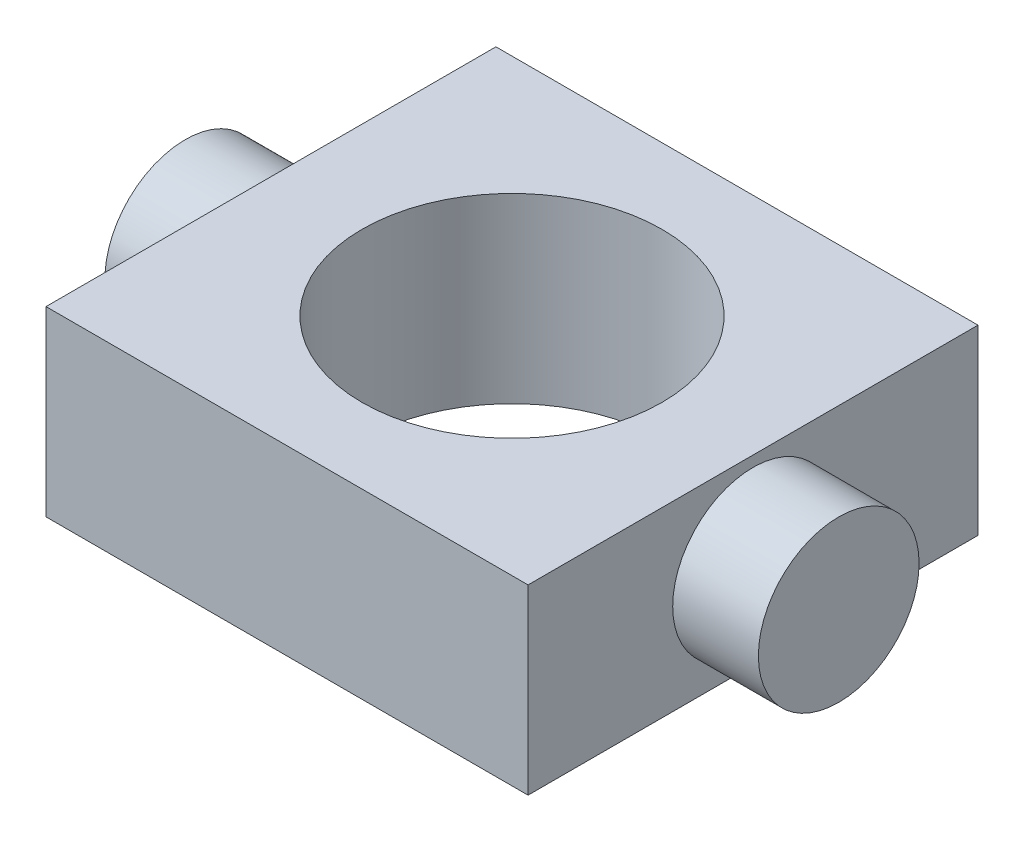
ISO-10303-21;
HEADER;
FILE_DESCRIPTION(('STEP AP214'),'2;1');
FILE_NAME('part.step','',(''),(''),'','','');
FILE_SCHEMA(('AUTOMOTIVE_DESIGN { 1 0 10303 214 1 1 1 1 }'));
ENDSEC;
DATA;
#1=APPLICATION_CONTEXT('core data for automotive mechanical design processes');
#2=APPLICATION_PROTOCOL_DEFINITION('international standard','automotive_design',2000,#1);
#3=PRODUCT_CONTEXT('',#1,'mechanical');
#4=PRODUCT('Part','Part','',(#3));
#5=PRODUCT_RELATED_PRODUCT_CATEGORY('part','',(#4));
#6=PRODUCT_DEFINITION_FORMATION('','',#4);
#7=PRODUCT_DEFINITION_CONTEXT('part definition',#1,'design');
#8=PRODUCT_DEFINITION('design','',#6,#7);
#9=PRODUCT_DEFINITION_SHAPE('','',#8);
#10=(LENGTH_UNIT() NAMED_UNIT(*) SI_UNIT(.MILLI.,.METRE.));
#11=(NAMED_UNIT(*) PLANE_ANGLE_UNIT() SI_UNIT($,.RADIAN.));
#12=(NAMED_UNIT(*) SI_UNIT($,.STERADIAN.) SOLID_ANGLE_UNIT());
#13=UNCERTAINTY_MEASURE_WITH_UNIT(LENGTH_MEASURE(1.E-05),#10,'distance_accuracy_value','');
#14=(GEOMETRIC_REPRESENTATION_CONTEXT(3) GLOBAL_UNCERTAINTY_ASSIGNED_CONTEXT((#13)) GLOBAL_UNIT_ASSIGNED_CONTEXT((#10,
#11,#12)) REPRESENTATION_CONTEXT('',''));
#15=CARTESIAN_POINT('',(0.,0.,0.));
#16=DIRECTION('',(0.,0.,1.));
#17=DIRECTION('',(1.,0.,0.));
#18=AXIS2_PLACEMENT_3D('',#15,#16,#17);
#19=CARTESIAN_POINT('',(45.,0.,42.));
#20=DIRECTION('',(-1.,0.,0.));
#21=DIRECTION('',(0.,0.,1.));
#22=AXIS2_PLACEMENT_3D('',#19,#20,#21);
#23=PLANE('',#22);
#24=DIRECTION('',(0.,1.,0.));
#25=VECTOR('',#24,1.);
#26=CARTESIAN_POINT('',(45.,0.,0.));
#27=LINE('',#26,#25);
#28=CARTESIAN_POINT('',(45.,0.,0.));
#29=VERTEX_POINT('',#28);
#30=CARTESIAN_POINT('',(45.,17.,0.));
#31=VERTEX_POINT('',#30);
#32=EDGE_CURVE('E73',#29,#31,#27,.T.);
#33=ORIENTED_EDGE('',*,*,#32,.T.);
#34=DIRECTION('',(0.,0.,-1.));
#35=VECTOR('',#34,1.);
#36=CARTESIAN_POINT('',(45.,17.,42.));
#37=LINE('',#36,#35);
#38=CARTESIAN_POINT('',(45.,17.,42.));
#39=VERTEX_POINT('',#38);
#40=EDGE_CURVE('E102',#39,#31,#37,.T.);
#41=ORIENTED_EDGE('',*,*,#40,.F.);
#42=DIRECTION('',(0.,1.,0.));
#43=VECTOR('',#42,1.);
#44=CARTESIAN_POINT('',(45.,0.,42.));
#45=LINE('',#44,#43);
#46=CARTESIAN_POINT('',(45.,0.,42.));
#47=VERTEX_POINT('',#46);
#48=EDGE_CURVE('E46',#47,#39,#45,.T.);
#49=ORIENTED_EDGE('',*,*,#48,.F.);
#50=DIRECTION('',(0.,0.,-1.));
#51=VECTOR('',#50,1.);
#52=CARTESIAN_POINT('',(45.,0.,42.));
#53=LINE('',#52,#51);
#54=EDGE_CURVE('E83',#47,#29,#53,.T.);
#55=ORIENTED_EDGE('',*,*,#54,.T.);
#56=EDGE_LOOP('',(#33,#41,#49,#55));
#57=FACE_BOUND('',#56,.T.);
#58=CARTESIAN_POINT('',(45.,8.5,21.));
#59=DIRECTION('',(-1.,0.,0.));
#60=DIRECTION('',(0.,0.,1.));
#61=AXIS2_PLACEMENT_3D('',#58,#59,#60);
#62=CIRCLE('',#61,7.5);
#63=CARTESIAN_POINT('',(45.,8.5,28.5));
#64=VERTEX_POINT('',#63);
#65=EDGE_CURVE('E11',#64,#64,#62,.F.);
#66=ORIENTED_EDGE('',*,*,#65,.F.);
#67=EDGE_LOOP('',(#66));
#68=FACE_BOUND('',#67,.T.);
#69=ADVANCED_FACE('F26',(#57,#68),#23,.F.);
#70=CARTESIAN_POINT('',(0.,0.,42.));
#71=DIRECTION('',(1.,0.,0.));
#72=DIRECTION('',(0.,0.,-1.));
#73=AXIS2_PLACEMENT_3D('',#70,#71,#72);
#74=PLANE('',#73);
#75=CARTESIAN_POINT('',(0.,8.5,21.));
#76=DIRECTION('',(1.,0.,0.));
#77=DIRECTION('',(0.,0.,-1.));
#78=AXIS2_PLACEMENT_3D('',#75,#76,#77);
#79=CIRCLE('',#78,7.5);
#80=CARTESIAN_POINT('',(0.,8.5,13.5));
#81=VERTEX_POINT('',#80);
#82=EDGE_CURVE('E145',#81,#81,#79,.T.);
#83=ORIENTED_EDGE('',*,*,#82,.T.);
#84=EDGE_LOOP('',(#83));
#85=FACE_BOUND('',#84,.T.);
#86=DIRECTION('',(0.,-1.,0.));
#87=VECTOR('',#86,1.);
#88=CARTESIAN_POINT('',(0.,0.,0.));
#89=LINE('',#88,#87);
#90=CARTESIAN_POINT('',(0.,17.,0.));
#91=VERTEX_POINT('',#90);
#92=CARTESIAN_POINT('',(0.,0.,0.));
#93=VERTEX_POINT('',#92);
#94=EDGE_CURVE('E72',#91,#93,#89,.T.);
#95=ORIENTED_EDGE('',*,*,#94,.T.);
#96=DIRECTION('',(0.,0.,-1.));
#97=VECTOR('',#96,1.);
#98=CARTESIAN_POINT('',(0.,0.,42.));
#99=LINE('',#98,#97);
#100=CARTESIAN_POINT('',(0.,0.,42.));
#101=VERTEX_POINT('',#100);
#102=EDGE_CURVE('E34',#101,#93,#99,.T.);
#103=ORIENTED_EDGE('',*,*,#102,.F.);
#104=DIRECTION('',(0.,-1.,0.));
#105=VECTOR('',#104,1.);
#106=CARTESIAN_POINT('',(0.,0.,42.));
#107=LINE('',#106,#105);
#108=CARTESIAN_POINT('',(0.,17.,42.));
#109=VERTEX_POINT('',#108);
#110=EDGE_CURVE('E96',#109,#101,#107,.T.);
#111=ORIENTED_EDGE('',*,*,#110,.F.);
#112=DIRECTION('',(0.,0.,-1.));
#113=VECTOR('',#112,1.);
#114=CARTESIAN_POINT('',(0.,17.,42.));
#115=LINE('',#114,#113);
#116=EDGE_CURVE('E85',#109,#91,#115,.T.);
#117=ORIENTED_EDGE('',*,*,#116,.T.);
#118=EDGE_LOOP('',(#95,#103,#111,#117));
#119=FACE_BOUND('',#118,.T.);
#120=ADVANCED_FACE('F28',(#85,#119),#74,.F.);
#121=CARTESIAN_POINT('',(0.,0.,42.));
#122=DIRECTION('',(0.,1.,0.));
#123=DIRECTION('',(0.,0.,1.));
#124=AXIS2_PLACEMENT_3D('',#121,#122,#123);
#125=PLANE('',#124);
#126=CARTESIAN_POINT('',(22.5,0.,21.));
#127=DIRECTION('',(0.,1.,0.));
#128=DIRECTION('',(0.,0.,1.));
#129=AXIS2_PLACEMENT_3D('',#126,#127,#128);
#130=CIRCLE('',#129,14.);
#131=CARTESIAN_POINT('',(22.5,0.,35.));
#132=VERTEX_POINT('',#131);
#133=EDGE_CURVE('E86',#132,#132,#130,.T.);
#134=ORIENTED_EDGE('',*,*,#133,.T.);
#135=EDGE_LOOP('',(#134));
#136=FACE_BOUND('',#135,.T.);
#137=DIRECTION('',(1.,0.,0.));
#138=VECTOR('',#137,1.);
#139=CARTESIAN_POINT('',(0.,0.,0.));
#140=LINE('',#139,#138);
#141=EDGE_CURVE('E67',#93,#29,#140,.T.);
#142=ORIENTED_EDGE('',*,*,#141,.T.);
#143=ORIENTED_EDGE('',*,*,#54,.F.);
#144=DIRECTION('',(1.,0.,0.));
#145=VECTOR('',#144,1.);
#146=CARTESIAN_POINT('',(0.,0.,42.));
#147=LINE('',#146,#145);
#148=EDGE_CURVE('E80',#101,#47,#147,.T.);
#149=ORIENTED_EDGE('',*,*,#148,.F.);
#150=ORIENTED_EDGE('',*,*,#102,.T.);
#151=EDGE_LOOP('',(#142,#143,#149,#150));
#152=FACE_BOUND('',#151,.T.);
#153=ADVANCED_FACE('F79',(#136,#152),#125,.F.);
#154=CARTESIAN_POINT('',(0.,17.,42.));
#155=DIRECTION('',(0.,-1.,0.));
#156=DIRECTION('',(0.,0.,-1.));
#157=AXIS2_PLACEMENT_3D('',#154,#155,#156);
#158=PLANE('',#157);
#159=CARTESIAN_POINT('',(22.5,17.,21.));
#160=DIRECTION('',(0.,1.,0.));
#161=DIRECTION('',(0.,0.,1.));
#162=AXIS2_PLACEMENT_3D('',#159,#160,#161);
#163=CIRCLE('',#162,14.);
#164=CARTESIAN_POINT('',(22.5,17.,35.));
#165=VERTEX_POINT('',#164);
#166=EDGE_CURVE('E89',#165,#165,#163,.T.);
#167=ORIENTED_EDGE('',*,*,#166,.F.);
#168=EDGE_LOOP('',(#167));
#169=FACE_BOUND('',#168,.T.);
#170=DIRECTION('',(-1.,0.,0.));
#171=VECTOR('',#170,1.);
#172=CARTESIAN_POINT('',(0.,17.,0.));
#173=LINE('',#172,#171);
#174=EDGE_CURVE('E94',#31,#91,#173,.T.);
#175=ORIENTED_EDGE('',*,*,#174,.T.);
#176=ORIENTED_EDGE('',*,*,#116,.F.);
#177=DIRECTION('',(-1.,0.,0.));
#178=VECTOR('',#177,1.);
#179=CARTESIAN_POINT('',(0.,17.,42.));
#180=LINE('',#179,#178);
#181=EDGE_CURVE('E41',#39,#109,#180,.T.);
#182=ORIENTED_EDGE('',*,*,#181,.F.);
#183=ORIENTED_EDGE('',*,*,#40,.T.);
#184=EDGE_LOOP('',(#175,#176,#182,#183));
#185=FACE_BOUND('',#184,.T.);
#186=ADVANCED_FACE('F108',(#169,#185),#158,.F.);
#187=CARTESIAN_POINT('',(0.,17.,42.));
#188=DIRECTION('',(0.,0.,-1.));
#189=DIRECTION('',(-1.,0.,0.));
#190=AXIS2_PLACEMENT_3D('',#187,#188,#189);
#191=PLANE('',#190);
#192=ORIENTED_EDGE('',*,*,#110,.T.);
#193=ORIENTED_EDGE('',*,*,#148,.T.);
#194=ORIENTED_EDGE('',*,*,#48,.T.);
#195=ORIENTED_EDGE('',*,*,#181,.T.);
#196=EDGE_LOOP('',(#192,#193,#194,#195));
#197=FACE_BOUND('',#196,.T.);
#198=ADVANCED_FACE('F109',(#197),#191,.F.);
#199=CARTESIAN_POINT('',(0.,17.,0.));
#200=DIRECTION('',(0.,0.,-1.));
#201=DIRECTION('',(-1.,0.,0.));
#202=AXIS2_PLACEMENT_3D('',#199,#200,#201);
#203=PLANE('',#202);
#204=ORIENTED_EDGE('',*,*,#94,.F.);
#205=ORIENTED_EDGE('',*,*,#174,.F.);
#206=ORIENTED_EDGE('',*,*,#32,.F.);
#207=ORIENTED_EDGE('',*,*,#141,.F.);
#208=EDGE_LOOP('',(#204,#205,#206,#207));
#209=FACE_BOUND('',#208,.T.);
#210=ADVANCED_FACE('F69',(#209),#203,.T.);
#211=CARTESIAN_POINT('',(22.5,0.,21.));
#212=DIRECTION('',(0.,1.,0.));
#213=DIRECTION('',(0.,0.,1.));
#214=AXIS2_PLACEMENT_3D('',#211,#212,#213);
#215=CYLINDRICAL_SURFACE('',#214,14.);
#216=ORIENTED_EDGE('',*,*,#133,.F.);
#217=EDGE_LOOP('',(#216));
#218=FACE_BOUND('',#217,.T.);
#219=ORIENTED_EDGE('',*,*,#166,.T.);
#220=EDGE_LOOP('',(#219));
#221=FACE_BOUND('',#220,.T.);
#222=ADVANCED_FACE('F116',(#218,#221),#215,.F.);
#223=CARTESIAN_POINT('',(53.,8.5,21.));
#224=DIRECTION('',(-1.,0.,0.));
#225=DIRECTION('',(0.,0.,1.));
#226=AXIS2_PLACEMENT_3D('',#223,#224,#225);
#227=CYLINDRICAL_SURFACE('',#226,7.5);
#228=CARTESIAN_POINT('',(53.,8.5,21.));
#229=DIRECTION('',(1.,0.,0.));
#230=DIRECTION('',(0.,0.,-1.));
#231=AXIS2_PLACEMENT_3D('',#228,#229,#230);
#232=CIRCLE('',#231,7.5);
#233=CARTESIAN_POINT('',(53.,8.5,13.5));
#234=VERTEX_POINT('',#233);
#235=EDGE_CURVE('E138',#234,#234,#232,.T.);
#236=ORIENTED_EDGE('',*,*,#235,.F.);
#237=EDGE_LOOP('',(#236));
#238=FACE_BOUND('',#237,.T.);
#239=ORIENTED_EDGE('',*,*,#65,.T.);
#240=EDGE_LOOP('',(#239));
#241=FACE_BOUND('',#240,.T.);
#242=ADVANCED_FACE('F134',(#238,#241),#227,.T.);
#243=CARTESIAN_POINT('',(53.,8.5,21.));
#244=DIRECTION('',(1.,0.,0.));
#245=DIRECTION('',(0.,0.,-1.));
#246=AXIS2_PLACEMENT_3D('',#243,#244,#245);
#247=PLANE('',#246);
#248=ORIENTED_EDGE('',*,*,#235,.T.);
#249=EDGE_LOOP('',(#248));
#250=FACE_BOUND('',#249,.T.);
#251=ADVANCED_FACE('F152',(#250),#247,.T.);
#252=CARTESIAN_POINT('',(-8.,8.5,21.));
#253=DIRECTION('',(1.,0.,0.));
#254=DIRECTION('',(0.,0.,-1.));
#255=AXIS2_PLACEMENT_3D('',#252,#253,#254);
#256=CYLINDRICAL_SURFACE('',#255,7.5);
#257=CARTESIAN_POINT('',(-8.,8.5,21.));
#258=DIRECTION('',(1.,0.,0.));
#259=DIRECTION('',(0.,0.,-1.));
#260=AXIS2_PLACEMENT_3D('',#257,#258,#259);
#261=CIRCLE('',#260,7.5);
#262=CARTESIAN_POINT('',(-8.,8.5,13.5));
#263=VERTEX_POINT('',#262);
#264=EDGE_CURVE('E140',#263,#263,#261,.T.);
#265=ORIENTED_EDGE('',*,*,#264,.T.);
#266=EDGE_LOOP('',(#265));
#267=FACE_BOUND('',#266,.T.);
#268=ORIENTED_EDGE('',*,*,#82,.F.);
#269=EDGE_LOOP('',(#268));
#270=FACE_BOUND('',#269,.T.);
#271=ADVANCED_FACE('F149',(#267,#270),#256,.T.);
#272=CARTESIAN_POINT('',(-8.,8.5,21.));
#273=DIRECTION('',(-1.,0.,0.));
#274=DIRECTION('',(0.,0.,-1.));
#275=AXIS2_PLACEMENT_3D('',#272,#273,#274);
#276=PLANE('',#275);
#277=ORIENTED_EDGE('',*,*,#264,.F.);
#278=EDGE_LOOP('',(#277));
#279=FACE_BOUND('',#278,.T.);
#280=ADVANCED_FACE('F151',(#279),#276,.T.);
#281=CLOSED_SHELL('',(#69,#120,#153,#186,#198,#210,#222,#242,#251,#271,#280));
#282=MANIFOLD_SOLID_BREP('B2',#281);
#283=ADVANCED_BREP_SHAPE_REPRESENTATION('',(#18,#282),#14);
#284=SHAPE_DEFINITION_REPRESENTATION(#9,#283);
ENDSEC;
END-ISO-10303-21;
